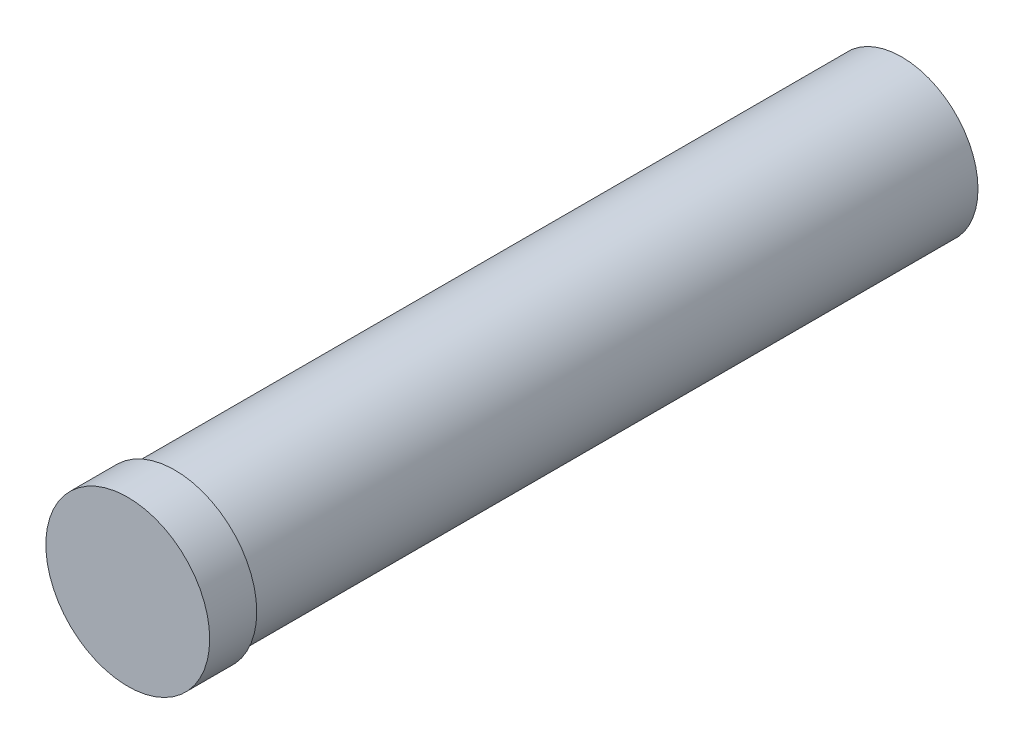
ISO-10303-21;
HEADER;
FILE_DESCRIPTION(('STEP AP214'),'2;1');
FILE_NAME('part.step','',(''),(''),'','','');
FILE_SCHEMA(('AUTOMOTIVE_DESIGN { 1 0 10303 214 1 1 1 1 }'));
ENDSEC;
DATA;
#1=APPLICATION_CONTEXT('core data for automotive mechanical design processes');
#2=APPLICATION_PROTOCOL_DEFINITION('international standard','automotive_design',2000,#1);
#3=PRODUCT_CONTEXT('',#1,'mechanical');
#4=PRODUCT('Part','Part','',(#3));
#5=PRODUCT_RELATED_PRODUCT_CATEGORY('part','',(#4));
#6=PRODUCT_DEFINITION_FORMATION('','',#4);
#7=PRODUCT_DEFINITION_CONTEXT('part definition',#1,'design');
#8=PRODUCT_DEFINITION('design','',#6,#7);
#9=PRODUCT_DEFINITION_SHAPE('','',#8);
#10=(LENGTH_UNIT() NAMED_UNIT(*) SI_UNIT(.MILLI.,.METRE.));
#11=(NAMED_UNIT(*) PLANE_ANGLE_UNIT() SI_UNIT($,.RADIAN.));
#12=(NAMED_UNIT(*) SI_UNIT($,.STERADIAN.) SOLID_ANGLE_UNIT());
#13=UNCERTAINTY_MEASURE_WITH_UNIT(LENGTH_MEASURE(1.E-05),#10,'distance_accuracy_value','');
#14=(GEOMETRIC_REPRESENTATION_CONTEXT(3) GLOBAL_UNCERTAINTY_ASSIGNED_CONTEXT((#13)) GLOBAL_UNIT_ASSIGNED_CONTEXT((#10,
#11,#12)) REPRESENTATION_CONTEXT('',''));
#15=CARTESIAN_POINT('',(0.,0.,0.));
#16=DIRECTION('',(0.,0.,1.));
#17=DIRECTION('',(1.,0.,0.));
#18=AXIS2_PLACEMENT_3D('',#15,#16,#17);
#19=CARTESIAN_POINT('',(0.,0.,-862.));
#20=DIRECTION('',(0.,0.,-1.));
#21=DIRECTION('',(-1.,0.,0.));
#22=AXIS2_PLACEMENT_3D('',#19,#20,#21);
#23=PLANE('',#22);
#24=CARTESIAN_POINT('',(0.,0.,-862.));
#25=DIRECTION('',(0.,0.,-1.));
#26=DIRECTION('',(-1.,0.,0.));
#27=AXIS2_PLACEMENT_3D('',#24,#25,#26);
#28=CIRCLE('',#27,79.);
#29=CARTESIAN_POINT('',(-79.,0.,-862.));
#30=VERTEX_POINT('',#29);
#31=EDGE_CURVE('E49',#30,#30,#28,.F.);
#32=ORIENTED_EDGE('',*,*,#31,.T.);
#33=EDGE_LOOP('',(#32));
#34=FACE_BOUND('',#33,.T.);
#35=CARTESIAN_POINT('',(0.,0.,-862.));
#36=DIRECTION('',(0.,0.,-1.));
#37=DIRECTION('',(-1.,0.,0.));
#38=AXIS2_PLACEMENT_3D('',#35,#36,#37);
#39=CIRCLE('',#38,85.);
#40=CARTESIAN_POINT('',(-85.,0.,-862.));
#41=VERTEX_POINT('',#40);
#42=EDGE_CURVE('E65',#41,#41,#39,.T.);
#43=ORIENTED_EDGE('',*,*,#42,.T.);
#44=EDGE_LOOP('',(#43));
#45=FACE_BOUND('',#44,.T.);
#46=ADVANCED_FACE('F42',(#34,#45),#23,.T.);
#47=CARTESIAN_POINT('',(0.,0.,-52.4));
#48=DIRECTION('',(0.,0.,1.));
#49=DIRECTION('',(1.,0.,0.));
#50=AXIS2_PLACEMENT_3D('',#47,#48,#49);
#51=PLANE('',#50);
#52=CARTESIAN_POINT('',(0.,0.,-52.4));
#53=DIRECTION('',(0.,0.,1.));
#54=DIRECTION('',(1.,0.,0.));
#55=AXIS2_PLACEMENT_3D('',#52,#53,#54);
#56=CIRCLE('',#55,91.25);
#57=CARTESIAN_POINT('',(91.25,0.,-52.4));
#58=VERTEX_POINT('',#57);
#59=EDGE_CURVE('E57',#58,#58,#56,.T.);
#60=ORIENTED_EDGE('',*,*,#59,.F.);
#61=EDGE_LOOP('',(#60));
#62=FACE_BOUND('',#61,.T.);
#63=CARTESIAN_POINT('',(0.,0.,-52.4));
#64=DIRECTION('',(0.,0.,1.));
#65=DIRECTION('',(1.,0.,0.));
#66=AXIS2_PLACEMENT_3D('',#63,#64,#65);
#67=CIRCLE('',#66,85.);
#68=CARTESIAN_POINT('',(85.,0.,-52.4));
#69=VERTEX_POINT('',#68);
#70=EDGE_CURVE('E53',#69,#69,#67,.F.);
#71=ORIENTED_EDGE('',*,*,#70,.F.);
#72=EDGE_LOOP('',(#71));
#73=FACE_BOUND('',#72,.T.);
#74=ADVANCED_FACE('F98',(#62,#73),#51,.F.);
#75=CARTESIAN_POINT('',(0.,0.,-52.4));
#76=DIRECTION('',(0.,0.,1.));
#77=DIRECTION('',(1.,0.,0.));
#78=AXIS2_PLACEMENT_3D('',#75,#76,#77);
#79=CYLINDRICAL_SURFACE('',#78,91.25);
#80=ORIENTED_EDGE('',*,*,#59,.T.);
#81=EDGE_LOOP('',(#80));
#82=FACE_BOUND('',#81,.T.);
#83=CARTESIAN_POINT('',(0.,0.,0.));
#84=DIRECTION('',(0.,0.,1.));
#85=DIRECTION('',(1.,0.,0.));
#86=AXIS2_PLACEMENT_3D('',#83,#84,#85);
#87=CIRCLE('',#86,91.25);
#88=CARTESIAN_POINT('',(91.25,0.,0.));
#89=VERTEX_POINT('',#88);
#90=EDGE_CURVE('E62',#89,#89,#87,.T.);
#91=ORIENTED_EDGE('',*,*,#90,.F.);
#92=EDGE_LOOP('',(#91));
#93=FACE_BOUND('',#92,.T.);
#94=ADVANCED_FACE('F103',(#82,#93),#79,.T.);
#95=CARTESIAN_POINT('',(0.,0.,0.));
#96=DIRECTION('',(0.,0.,1.));
#97=DIRECTION('',(1.,0.,0.));
#98=AXIS2_PLACEMENT_3D('',#95,#96,#97);
#99=PLANE('',#98);
#100=ORIENTED_EDGE('',*,*,#90,.T.);
#101=EDGE_LOOP('',(#100));
#102=FACE_BOUND('',#101,.T.);
#103=ADVANCED_FACE('F114',(#102),#99,.T.);
#104=CARTESIAN_POINT('',(0.,0.,-862.));
#105=DIRECTION('',(0.,0.,1.));
#106=DIRECTION('',(1.,0.,0.));
#107=AXIS2_PLACEMENT_3D('',#104,#105,#106);
#108=CYLINDRICAL_SURFACE('',#107,85.);
#109=ORIENTED_EDGE('',*,*,#42,.F.);
#110=EDGE_LOOP('',(#109));
#111=FACE_BOUND('',#110,.T.);
#112=ORIENTED_EDGE('',*,*,#70,.T.);
#113=EDGE_LOOP('',(#112));
#114=FACE_BOUND('',#113,.T.);
#115=ADVANCED_FACE('F111',(#111,#114),#108,.T.);
#116=CARTESIAN_POINT('',(0.,0.,0.));
#117=DIRECTION('',(0.,0.,1.));
#118=DIRECTION('',(1.,0.,0.));
#119=AXIS2_PLACEMENT_3D('',#116,#117,#118);
#120=CYLINDRICAL_SURFACE('',#119,77.0000000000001);
#121=CARTESIAN_POINT('',(0.,0.,-860.));
#122=DIRECTION('',(0.,0.,-1.));
#123=DIRECTION('',(-1.,0.,0.));
#124=AXIS2_PLACEMENT_3D('',#121,#122,#123);
#125=CIRCLE('',#124,77.0000000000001);
#126=CARTESIAN_POINT('',(-77.0000000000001,0.,-860.));
#127=VERTEX_POINT('',#126);
#128=EDGE_CURVE('E12',#127,#127,#125,.T.);
#129=ORIENTED_EDGE('',*,*,#128,.T.);
#130=EDGE_LOOP('',(#129));
#131=FACE_BOUND('',#130,.T.);
#132=CARTESIAN_POINT('',(0.,0.,-823.));
#133=DIRECTION('',(0.,0.,1.));
#134=DIRECTION('',(1.,0.,0.));
#135=AXIS2_PLACEMENT_3D('',#132,#133,#134);
#136=CIRCLE('',#135,77.0000000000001);
#137=CARTESIAN_POINT('',(77.0000000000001,0.,-823.));
#138=VERTEX_POINT('',#137);
#139=EDGE_CURVE('E68',#138,#138,#136,.T.);
#140=ORIENTED_EDGE('',*,*,#139,.T.);
#141=EDGE_LOOP('',(#140));
#142=FACE_BOUND('',#141,.T.);
#143=ADVANCED_FACE('F109',(#131,#142),#120,.F.);
#144=CARTESIAN_POINT('',(0.,77.0000000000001,-823.));
#145=DIRECTION('',(0.,0.,-1.));
#146=DIRECTION('',(-1.,0.,0.));
#147=AXIS2_PLACEMENT_3D('',#144,#145,#146);
#148=PLANE('',#147);
#149=CARTESIAN_POINT('',(0.,0.,-823.));
#150=DIRECTION('',(0.,0.,1.));
#151=DIRECTION('',(1.,0.,0.));
#152=AXIS2_PLACEMENT_3D('',#149,#150,#151);
#153=CIRCLE('',#152,74.0000000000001);
#154=CARTESIAN_POINT('',(74.0000000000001,0.,-823.));
#155=VERTEX_POINT('',#154);
#156=EDGE_CURVE('E71',#155,#155,#153,.T.);
#157=ORIENTED_EDGE('',*,*,#156,.T.);
#158=EDGE_LOOP('',(#157));
#159=FACE_BOUND('',#158,.T.);
#160=ORIENTED_EDGE('',*,*,#139,.F.);
#161=EDGE_LOOP('',(#160));
#162=FACE_BOUND('',#161,.T.);
#163=ADVANCED_FACE('F145',(#159,#162),#148,.T.);
#164=CARTESIAN_POINT('',(0.,0.,0.));
#165=DIRECTION('',(0.,0.,1.));
#166=DIRECTION('',(1.,0.,0.));
#167=AXIS2_PLACEMENT_3D('',#164,#165,#166);
#168=CYLINDRICAL_SURFACE('',#167,74.0000000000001);
#169=CARTESIAN_POINT('',(0.,0.,-788.));
#170=DIRECTION('',(0.,0.,1.));
#171=DIRECTION('',(1.,0.,0.));
#172=AXIS2_PLACEMENT_3D('',#169,#170,#171);
#173=CIRCLE('',#172,74.0000000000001);
#174=CARTESIAN_POINT('',(74.0000000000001,0.,-788.));
#175=VERTEX_POINT('',#174);
#176=EDGE_CURVE('E74',#175,#175,#173,.T.);
#177=ORIENTED_EDGE('',*,*,#176,.T.);
#178=EDGE_LOOP('',(#177));
#179=FACE_BOUND('',#178,.T.);
#180=ORIENTED_EDGE('',*,*,#156,.F.);
#181=EDGE_LOOP('',(#180));
#182=FACE_BOUND('',#181,.T.);
#183=ADVANCED_FACE('F151',(#179,#182),#168,.F.);
#184=CARTESIAN_POINT('',(0.,74.0000000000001,-788.));
#185=DIRECTION('',(0.,0.,-1.));
#186=DIRECTION('',(-1.,0.,0.));
#187=AXIS2_PLACEMENT_3D('',#184,#185,#186);
#188=PLANE('',#187);
#189=CARTESIAN_POINT('',(0.,0.,-788.));
#190=DIRECTION('',(0.,0.,1.));
#191=DIRECTION('',(1.,0.,0.));
#192=AXIS2_PLACEMENT_3D('',#189,#190,#191);
#193=CIRCLE('',#192,70.0000000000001);
#194=CARTESIAN_POINT('',(70.0000000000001,0.,-788.));
#195=VERTEX_POINT('',#194);
#196=EDGE_CURVE('E77',#195,#195,#193,.T.);
#197=ORIENTED_EDGE('',*,*,#196,.T.);
#198=EDGE_LOOP('',(#197));
#199=FACE_BOUND('',#198,.T.);
#200=ORIENTED_EDGE('',*,*,#176,.F.);
#201=EDGE_LOOP('',(#200));
#202=FACE_BOUND('',#201,.T.);
#203=ADVANCED_FACE('F95',(#199,#202),#188,.T.);
#204=CARTESIAN_POINT('',(0.,0.,0.));
#205=DIRECTION('',(0.,0.,1.));
#206=DIRECTION('',(1.,0.,0.));
#207=AXIS2_PLACEMENT_3D('',#204,#205,#206);
#208=CYLINDRICAL_SURFACE('',#207,70.);
#209=CARTESIAN_POINT('',(0.,0.,-60.));
#210=DIRECTION('',(0.,0.,1.));
#211=DIRECTION('',(1.,0.,0.));
#212=AXIS2_PLACEMENT_3D('',#209,#210,#211);
#213=CIRCLE('',#212,70.);
#214=CARTESIAN_POINT('',(70.,0.,-60.));
#215=VERTEX_POINT('',#214);
#216=EDGE_CURVE('E80',#215,#215,#213,.T.);
#217=ORIENTED_EDGE('',*,*,#216,.T.);
#218=EDGE_LOOP('',(#217));
#219=FACE_BOUND('',#218,.T.);
#220=ORIENTED_EDGE('',*,*,#196,.F.);
#221=EDGE_LOOP('',(#220));
#222=FACE_BOUND('',#221,.T.);
#223=ADVANCED_FACE('F84',(#219,#222),#208,.F.);
#224=CARTESIAN_POINT('',(0.,70.,-60.));
#225=DIRECTION('',(0.,0.,-1.));
#226=DIRECTION('',(-1.,0.,0.));
#227=AXIS2_PLACEMENT_3D('',#224,#225,#226);
#228=PLANE('',#227);
#229=ORIENTED_EDGE('',*,*,#216,.F.);
#230=EDGE_LOOP('',(#229));
#231=FACE_BOUND('',#230,.T.);
#232=ADVANCED_FACE('F87',(#231),#228,.T.);
#233=CARTESIAN_POINT('',(0.,0.,-862.));
#234=DIRECTION('',(0.,0.,-1.));
#235=DIRECTION('',(-1.,0.,0.));
#236=AXIS2_PLACEMENT_3D('',#233,#234,#235);
#237=CONICAL_SURFACE('',#236,79.,0.785398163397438);
#238=ORIENTED_EDGE('',*,*,#128,.F.);
#239=EDGE_LOOP('',(#238));
#240=FACE_BOUND('',#239,.T.);
#241=ORIENTED_EDGE('',*,*,#31,.F.);
#242=EDGE_LOOP('',(#241));
#243=FACE_BOUND('',#242,.T.);
#244=ADVANCED_FACE('F44',(#240,#243),#237,.F.);
#245=CLOSED_SHELL('',(#46,#74,#94,#103,#115,#143,#163,#183,#203,#223,#232,#244));
#246=MANIFOLD_SOLID_BREP('B2',#245);
#247=ADVANCED_BREP_SHAPE_REPRESENTATION('',(#18,#246),#14);
#248=SHAPE_DEFINITION_REPRESENTATION(#9,#247);
ENDSEC;
END-ISO-10303-21;
